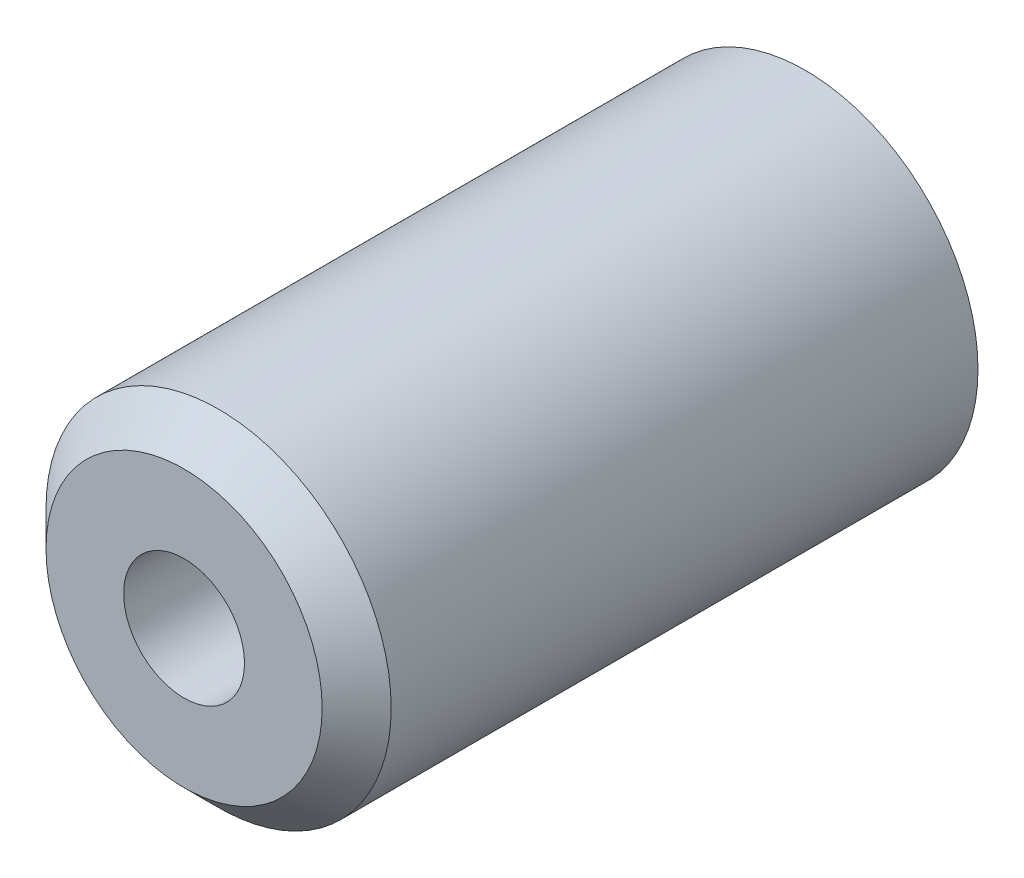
from build123d import *

# Parameters (mm, degrees)
SKETCH1_R      = 5
SKETCH1_R_2    = 1.75
EXTRUDE1_DEPTH = 18
CHAMFER1_SIZE  = 1


with BuildPart() as part:
    # Sketch1 → Extrude1 (new body)
    with BuildSketch(Plane.XY):
        Circle(SKETCH1_R)
        Circle(SKETCH1_R_2, mode=Mode.SUBTRACT)
    extrude(amount=EXTRUDE1_DEPTH)

    # Chamfer1
    chamfer1_edges = [part.edges().sort_by_distance(p)[0] for p in [
        (-5, 0, 18),
    ]]
    chamfer(chamfer1_edges, length=CHAMFER1_SIZE)


solid = part.part
